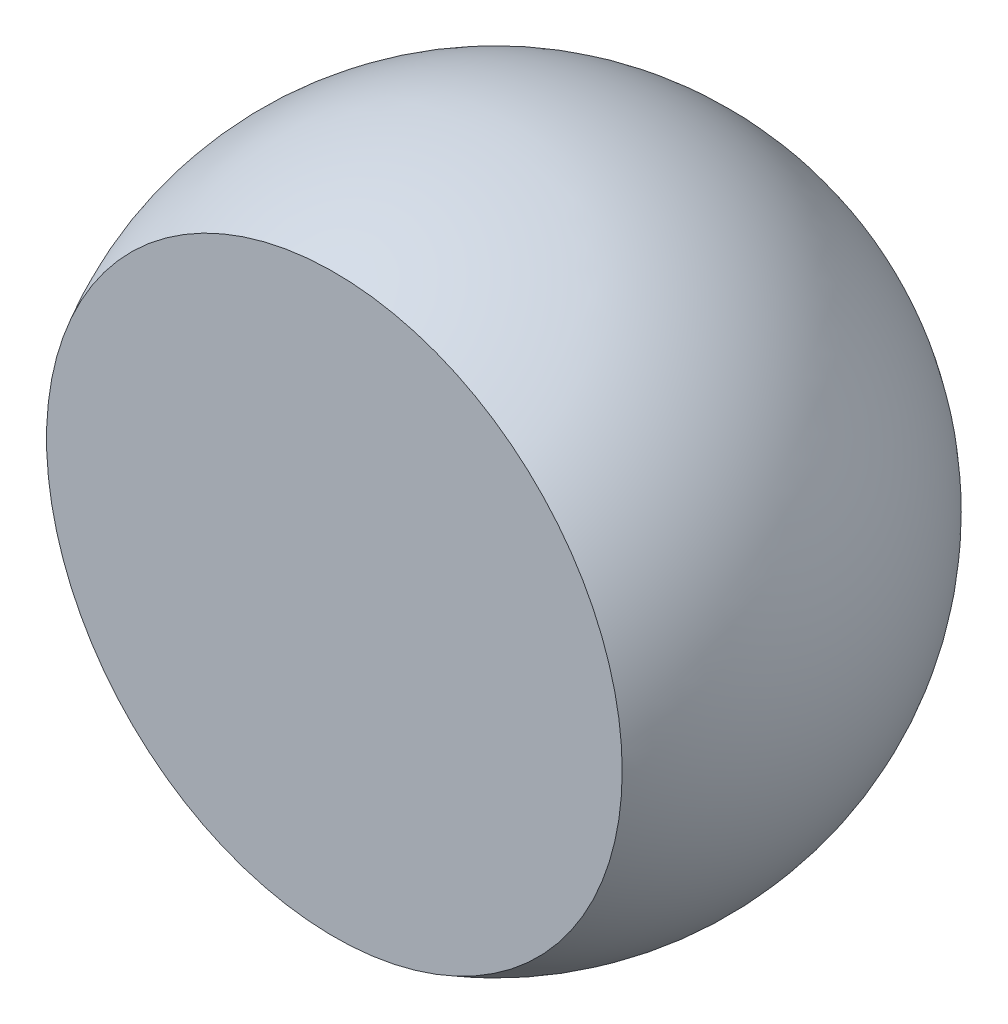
ISO-10303-21;
HEADER;
FILE_DESCRIPTION(('STEP AP214'),'2;1');
FILE_NAME('part.step','',(''),(''),'','','');
FILE_SCHEMA(('AUTOMOTIVE_DESIGN { 1 0 10303 214 1 1 1 1 }'));
ENDSEC;
DATA;
#1=APPLICATION_CONTEXT('core data for automotive mechanical design processes');
#2=APPLICATION_PROTOCOL_DEFINITION('international standard','automotive_design',2000,#1);
#3=PRODUCT_CONTEXT('',#1,'mechanical');
#4=PRODUCT('Part','Part','',(#3));
#5=PRODUCT_RELATED_PRODUCT_CATEGORY('part','',(#4));
#6=PRODUCT_DEFINITION_FORMATION('','',#4);
#7=PRODUCT_DEFINITION_CONTEXT('part definition',#1,'design');
#8=PRODUCT_DEFINITION('design','',#6,#7);
#9=PRODUCT_DEFINITION_SHAPE('','',#8);
#10=(LENGTH_UNIT() NAMED_UNIT(*) SI_UNIT(.MILLI.,.METRE.));
#11=(NAMED_UNIT(*) PLANE_ANGLE_UNIT() SI_UNIT($,.RADIAN.));
#12=(NAMED_UNIT(*) SI_UNIT($,.STERADIAN.) SOLID_ANGLE_UNIT());
#13=UNCERTAINTY_MEASURE_WITH_UNIT(LENGTH_MEASURE(1.E-05),#10,'distance_accuracy_value','');
#14=(GEOMETRIC_REPRESENTATION_CONTEXT(3) GLOBAL_UNCERTAINTY_ASSIGNED_CONTEXT((#13)) GLOBAL_UNIT_ASSIGNED_CONTEXT((#10,
#11,#12)) REPRESENTATION_CONTEXT('',''));
#15=CARTESIAN_POINT('',(0.,0.,0.));
#16=DIRECTION('',(0.,0.,1.));
#17=DIRECTION('',(1.,0.,0.));
#18=AXIS2_PLACEMENT_3D('',#15,#16,#17);
#19=CARTESIAN_POINT('',(0.,0.,0.));
#20=DIRECTION('',(-1.,0.,0.));
#21=DIRECTION('',(0.,0.,-1.));
#22=AXIS2_PLACEMENT_3D('',#19,#20,#21);
#23=SPHERICAL_SURFACE('',#22,50.);
#24=CARTESIAN_POINT('',(0.,0.,0.));
#25=DIRECTION('',(0.,0.,1.));
#26=DIRECTION('',(1.,0.,0.));
#27=AXIS2_PLACEMENT_3D('',#24,#25,#26);
#28=SPHERICAL_SURFACE('',#27,50.);
#29=CARTESIAN_POINT('',(0.,0.,24.3720658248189));
#30=DIRECTION('',(0.,0.,1.));
#31=DIRECTION('',(1.,0.,0.));
#32=AXIS2_PLACEMENT_3D('',#29,#30,#31);
#33=CIRCLE('',#32,43.6577874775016);
#34=CARTESIAN_POINT('',(43.6577874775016,0.,24.3720658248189));
#35=VERTEX_POINT('',#34);
#36=EDGE_CURVE('E10',#35,#35,#33,.T.);
#37=ORIENTED_EDGE('',*,*,#36,.F.);
#38=EDGE_LOOP('',(#37));
#39=FACE_BOUND('',#38,.T.);
#40=ADVANCED_FACE('F43',(#39),#28,.T.);
#41=CARTESIAN_POINT('',(-43.6577874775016,50.,24.3720658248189));
#42=DIRECTION('',(0.,0.,1.));
#43=DIRECTION('',(1.,0.,0.));
#44=AXIS2_PLACEMENT_3D('',#41,#42,#43);
#45=PLANE('',#44);
#46=ORIENTED_EDGE('',*,*,#36,.T.);
#47=EDGE_LOOP('',(#46));
#48=FACE_BOUND('',#47,.T.);
#49=ADVANCED_FACE('F51',(#48),#45,.T.);
#50=CLOSED_SHELL('',(#40,#49));
#51=MANIFOLD_SOLID_BREP('B2',#50);
#52=ADVANCED_BREP_SHAPE_REPRESENTATION('',(#18,#51),#14);
#53=SHAPE_DEFINITION_REPRESENTATION(#9,#52);
ENDSEC;
END-ISO-10303-21;
